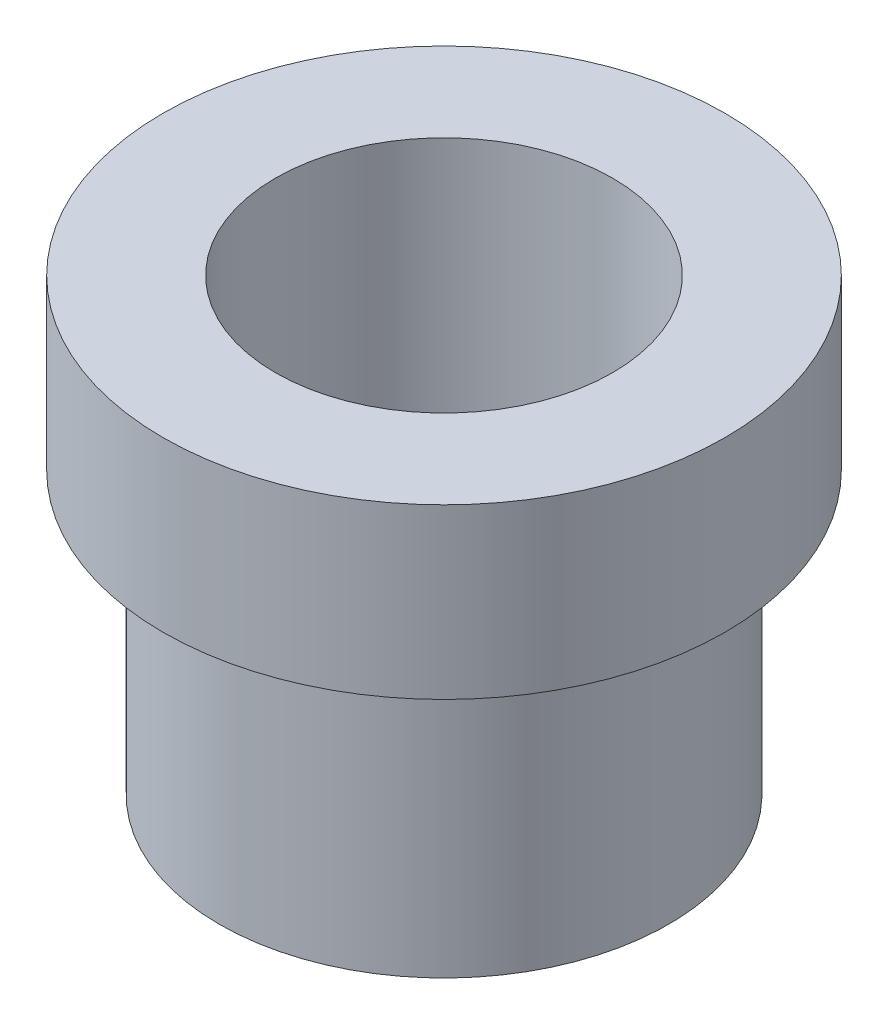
ISO-10303-21;
HEADER;
FILE_DESCRIPTION(('STEP AP214'),'2;1');
FILE_NAME('part.step','',(''),(''),'','','');
FILE_SCHEMA(('AUTOMOTIVE_DESIGN { 1 0 10303 214 1 1 1 1 }'));
ENDSEC;
DATA;
#1=APPLICATION_CONTEXT('core data for automotive mechanical design processes');
#2=APPLICATION_PROTOCOL_DEFINITION('international standard','automotive_design',2000,#1);
#3=PRODUCT_CONTEXT('',#1,'mechanical');
#4=PRODUCT('Part','Part','',(#3));
#5=PRODUCT_RELATED_PRODUCT_CATEGORY('part','',(#4));
#6=PRODUCT_DEFINITION_FORMATION('','',#4);
#7=PRODUCT_DEFINITION_CONTEXT('part definition',#1,'design');
#8=PRODUCT_DEFINITION('design','',#6,#7);
#9=PRODUCT_DEFINITION_SHAPE('','',#8);
#10=(LENGTH_UNIT() NAMED_UNIT(*) SI_UNIT(.MILLI.,.METRE.));
#11=(NAMED_UNIT(*) PLANE_ANGLE_UNIT() SI_UNIT($,.RADIAN.));
#12=(NAMED_UNIT(*) SI_UNIT($,.STERADIAN.) SOLID_ANGLE_UNIT());
#13=UNCERTAINTY_MEASURE_WITH_UNIT(LENGTH_MEASURE(1.E-05),#10,'distance_accuracy_value','');
#14=(GEOMETRIC_REPRESENTATION_CONTEXT(3) GLOBAL_UNCERTAINTY_ASSIGNED_CONTEXT((#13)) GLOBAL_UNIT_ASSIGNED_CONTEXT((#10,
#11,#12)) REPRESENTATION_CONTEXT('',''));
#15=CARTESIAN_POINT('',(0.,0.,0.));
#16=DIRECTION('',(0.,0.,1.));
#17=DIRECTION('',(1.,0.,0.));
#18=AXIS2_PLACEMENT_3D('',#15,#16,#17);
#19=CARTESIAN_POINT('',(0.,5.,0.));
#20=DIRECTION('',(0.,-1.,0.));
#21=DIRECTION('',(0.,0.,-1.));
#22=AXIS2_PLACEMENT_3D('',#19,#20,#21);
#23=CYLINDRICAL_SURFACE('',#22,4.);
#24=CARTESIAN_POINT('',(0.,5.,0.));
#25=DIRECTION('',(0.,1.,0.));
#26=DIRECTION('',(0.,0.,1.));
#27=AXIS2_PLACEMENT_3D('',#24,#25,#26);
#28=CIRCLE('',#27,4.);
#29=CARTESIAN_POINT('',(0.,5.,4.));
#30=VERTEX_POINT('',#29);
#31=EDGE_CURVE('E10',#30,#30,#28,.T.);
#32=ORIENTED_EDGE('',*,*,#31,.F.);
#33=EDGE_LOOP('',(#32));
#34=FACE_BOUND('',#33,.T.);
#35=CARTESIAN_POINT('',(0.,0.,0.));
#36=DIRECTION('',(0.,1.,0.));
#37=DIRECTION('',(0.,0.,1.));
#38=AXIS2_PLACEMENT_3D('',#35,#36,#37);
#39=CIRCLE('',#38,4.);
#40=CARTESIAN_POINT('',(0.,0.,4.));
#41=VERTEX_POINT('',#40);
#42=EDGE_CURVE('E34',#41,#41,#39,.T.);
#43=ORIENTED_EDGE('',*,*,#42,.T.);
#44=EDGE_LOOP('',(#43));
#45=FACE_BOUND('',#44,.T.);
#46=ADVANCED_FACE('F31',(#34,#45),#23,.T.);
#47=CARTESIAN_POINT('',(0.,0.,0.));
#48=DIRECTION('',(0.,1.,0.));
#49=DIRECTION('',(0.,0.,1.));
#50=AXIS2_PLACEMENT_3D('',#47,#48,#49);
#51=PLANE('',#50);
#52=CARTESIAN_POINT('',(0.,0.,0.));
#53=DIRECTION('',(0.,1.,0.));
#54=DIRECTION('',(0.,0.,1.));
#55=AXIS2_PLACEMENT_3D('',#52,#53,#54);
#56=CIRCLE('',#55,3.);
#57=CARTESIAN_POINT('',(0.,0.,3.));
#58=VERTEX_POINT('',#57);
#59=EDGE_CURVE('E46',#58,#58,#56,.T.);
#60=ORIENTED_EDGE('',*,*,#59,.T.);
#61=EDGE_LOOP('',(#60));
#62=FACE_BOUND('',#61,.T.);
#63=ORIENTED_EDGE('',*,*,#42,.F.);
#64=EDGE_LOOP('',(#63));
#65=FACE_BOUND('',#64,.T.);
#66=ADVANCED_FACE('F55',(#62,#65),#51,.F.);
#67=CARTESIAN_POINT('',(0.,5.,0.));
#68=DIRECTION('',(0.,1.,0.));
#69=DIRECTION('',(0.,0.,1.));
#70=AXIS2_PLACEMENT_3D('',#67,#68,#69);
#71=PLANE('',#70);
#72=CARTESIAN_POINT('',(0.,5.,0.));
#73=DIRECTION('',(0.,1.,0.));
#74=DIRECTION('',(0.,0.,1.));
#75=AXIS2_PLACEMENT_3D('',#72,#73,#74);
#76=CIRCLE('',#75,5.);
#77=CARTESIAN_POINT('',(0.,5.,5.));
#78=VERTEX_POINT('',#77);
#79=EDGE_CURVE('E43',#78,#78,#76,.T.);
#80=ORIENTED_EDGE('',*,*,#79,.F.);
#81=EDGE_LOOP('',(#80));
#82=FACE_BOUND('',#81,.T.);
#83=ORIENTED_EDGE('',*,*,#31,.T.);
#84=EDGE_LOOP('',(#83));
#85=FACE_BOUND('',#84,.T.);
#86=ADVANCED_FACE('F73',(#82,#85),#71,.F.);
#87=CARTESIAN_POINT('',(0.,8.,0.));
#88=DIRECTION('',(0.,-1.,0.));
#89=DIRECTION('',(0.,0.,-1.));
#90=AXIS2_PLACEMENT_3D('',#87,#88,#89);
#91=CYLINDRICAL_SURFACE('',#90,5.);
#92=CARTESIAN_POINT('',(0.,8.,0.));
#93=DIRECTION('',(0.,1.,0.));
#94=DIRECTION('',(0.,0.,1.));
#95=AXIS2_PLACEMENT_3D('',#92,#93,#94);
#96=CIRCLE('',#95,5.);
#97=CARTESIAN_POINT('',(0.,8.,5.));
#98=VERTEX_POINT('',#97);
#99=EDGE_CURVE('E41',#98,#98,#96,.T.);
#100=ORIENTED_EDGE('',*,*,#99,.F.);
#101=EDGE_LOOP('',(#100));
#102=FACE_BOUND('',#101,.T.);
#103=ORIENTED_EDGE('',*,*,#79,.T.);
#104=EDGE_LOOP('',(#103));
#105=FACE_BOUND('',#104,.T.);
#106=ADVANCED_FACE('F67',(#102,#105),#91,.T.);
#107=CARTESIAN_POINT('',(0.,8.,0.));
#108=DIRECTION('',(0.,1.,0.));
#109=DIRECTION('',(0.,0.,1.));
#110=AXIS2_PLACEMENT_3D('',#107,#108,#109);
#111=PLANE('',#110);
#112=CARTESIAN_POINT('',(0.,8.,0.));
#113=DIRECTION('',(0.,1.,0.));
#114=DIRECTION('',(0.,0.,1.));
#115=AXIS2_PLACEMENT_3D('',#112,#113,#114);
#116=CIRCLE('',#115,3.);
#117=CARTESIAN_POINT('',(0.,8.,3.));
#118=VERTEX_POINT('',#117);
#119=EDGE_CURVE('E49',#118,#118,#116,.T.);
#120=ORIENTED_EDGE('',*,*,#119,.F.);
#121=EDGE_LOOP('',(#120));
#122=FACE_BOUND('',#121,.T.);
#123=ORIENTED_EDGE('',*,*,#99,.T.);
#124=EDGE_LOOP('',(#123));
#125=FACE_BOUND('',#124,.T.);
#126=ADVANCED_FACE('F61',(#122,#125),#111,.T.);
#127=CARTESIAN_POINT('',(0.,0.,0.));
#128=DIRECTION('',(0.,1.,0.));
#129=DIRECTION('',(0.,0.,1.));
#130=AXIS2_PLACEMENT_3D('',#127,#128,#129);
#131=CYLINDRICAL_SURFACE('',#130,3.);
#132=ORIENTED_EDGE('',*,*,#59,.F.);
#133=EDGE_LOOP('',(#132));
#134=FACE_BOUND('',#133,.T.);
#135=ORIENTED_EDGE('',*,*,#119,.T.);
#136=EDGE_LOOP('',(#135));
#137=FACE_BOUND('',#136,.T.);
#138=ADVANCED_FACE('F58',(#134,#137),#131,.F.);
#139=CLOSED_SHELL('',(#46,#66,#86,#106,#126,#138));
#140=MANIFOLD_SOLID_BREP('B2',#139);
#141=ADVANCED_BREP_SHAPE_REPRESENTATION('',(#18,#140),#14);
#142=SHAPE_DEFINITION_REPRESENTATION(#9,#141);
ENDSEC;
END-ISO-10303-21;
